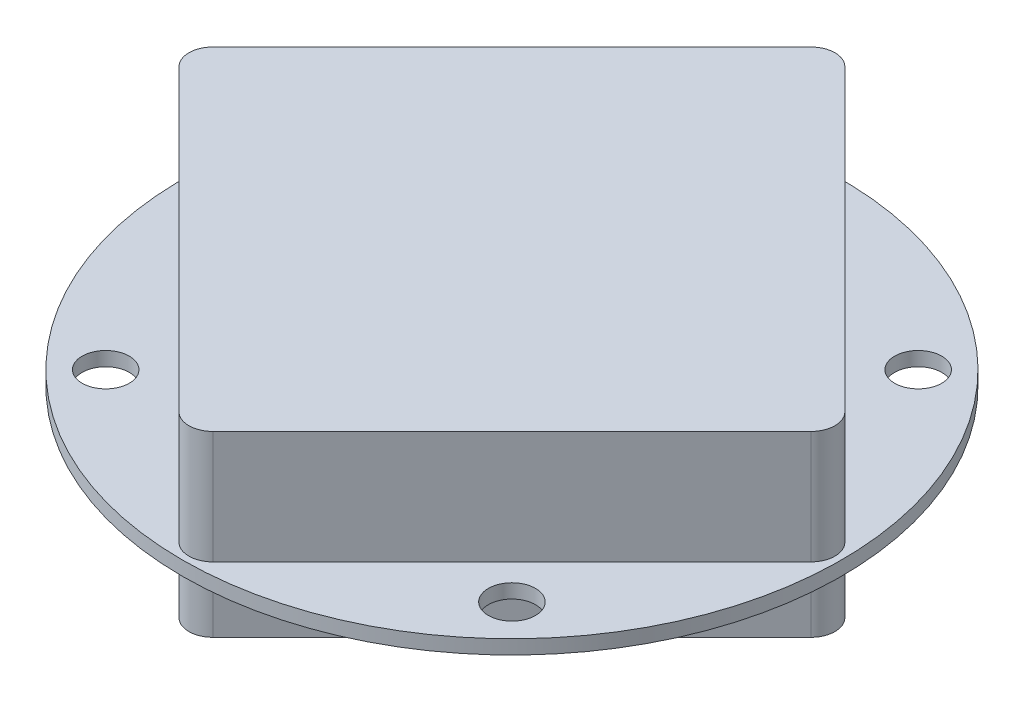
ISO-10303-21;
HEADER;
FILE_DESCRIPTION(('STEP AP214'),'2;1');
FILE_NAME('part.step','',(''),(''),'','','');
FILE_SCHEMA(('AUTOMOTIVE_DESIGN { 1 0 10303 214 1 1 1 1 }'));
ENDSEC;
DATA;
#1=APPLICATION_CONTEXT('core data for automotive mechanical design processes');
#2=APPLICATION_PROTOCOL_DEFINITION('international standard','automotive_design',2000,#1);
#3=PRODUCT_CONTEXT('',#1,'mechanical');
#4=PRODUCT('Part','Part','',(#3));
#5=PRODUCT_RELATED_PRODUCT_CATEGORY('part','',(#4));
#6=PRODUCT_DEFINITION_FORMATION('','',#4);
#7=PRODUCT_DEFINITION_CONTEXT('part definition',#1,'design');
#8=PRODUCT_DEFINITION('design','',#6,#7);
#9=PRODUCT_DEFINITION_SHAPE('','',#8);
#10=(LENGTH_UNIT() NAMED_UNIT(*) SI_UNIT(.MILLI.,.METRE.));
#11=(NAMED_UNIT(*) PLANE_ANGLE_UNIT() SI_UNIT($,.RADIAN.));
#12=(NAMED_UNIT(*) SI_UNIT($,.STERADIAN.) SOLID_ANGLE_UNIT());
#13=UNCERTAINTY_MEASURE_WITH_UNIT(LENGTH_MEASURE(1.E-05),#10,'distance_accuracy_value','');
#14=(GEOMETRIC_REPRESENTATION_CONTEXT(3) GLOBAL_UNCERTAINTY_ASSIGNED_CONTEXT((#13)) GLOBAL_UNIT_ASSIGNED_CONTEXT((#10,
#11,#12)) REPRESENTATION_CONTEXT('',''));
#15=CARTESIAN_POINT('',(0.,0.,0.));
#16=DIRECTION('',(0.,0.,1.));
#17=DIRECTION('',(1.,0.,0.));
#18=AXIS2_PLACEMENT_3D('',#15,#16,#17);
#19=CARTESIAN_POINT('',(0.,0.,0.));
#20=DIRECTION('',(0.,1.,0.));
#21=DIRECTION('',(0.,0.,1.));
#22=AXIS2_PLACEMENT_3D('',#19,#20,#21);
#23=PLANE('',#22);
#24=CARTESIAN_POINT('',(-10.6804635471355,0.,-10.6804635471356));
#25=DIRECTION('',(0.,1.,0.));
#26=DIRECTION('',(0.,0.,1.));
#27=AXIS2_PLACEMENT_3D('',#24,#25,#26);
#28=CIRCLE('',#27,1.24999999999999);
#29=CARTESIAN_POINT('',(-10.6804635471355,0.,-9.43046354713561));
#30=VERTEX_POINT('',#29);
#31=EDGE_CURVE('E319',#30,#30,#28,.T.);
#32=ORIENTED_EDGE('',*,*,#31,.T.);
#33=EDGE_LOOP('',(#32));
#34=FACE_BOUND('',#33,.T.);
#35=CARTESIAN_POINT('',(10.785449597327,0.,-10.7854495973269));
#36=DIRECTION('',(0.,1.,0.));
#37=DIRECTION('',(0.,0.,1.));
#38=AXIS2_PLACEMENT_3D('',#35,#36,#37);
#39=CIRCLE('',#38,1.24999999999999);
#40=CARTESIAN_POINT('',(10.785449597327,0.,-9.53544959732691));
#41=VERTEX_POINT('',#40);
#42=EDGE_CURVE('E313',#41,#41,#39,.T.);
#43=ORIENTED_EDGE('',*,*,#42,.T.);
#44=EDGE_LOOP('',(#43));
#45=FACE_BOUND('',#44,.T.);
#46=CARTESIAN_POINT('',(10.6804635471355,0.,10.6804635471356));
#47=DIRECTION('',(0.,1.,0.));
#48=DIRECTION('',(0.,0.,1.));
#49=AXIS2_PLACEMENT_3D('',#46,#47,#48);
#50=CIRCLE('',#49,1.24999999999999);
#51=CARTESIAN_POINT('',(10.6804635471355,0.,11.9304635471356));
#52=VERTEX_POINT('',#51);
#53=EDGE_CURVE('E307',#52,#52,#50,.T.);
#54=ORIENTED_EDGE('',*,*,#53,.T.);
#55=EDGE_LOOP('',(#54));
#56=FACE_BOUND('',#55,.T.);
#57=CARTESIAN_POINT('',(-10.785449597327,0.,10.7854495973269));
#58=DIRECTION('',(0.,1.,0.));
#59=DIRECTION('',(0.,0.,1.));
#60=AXIS2_PLACEMENT_3D('',#57,#58,#59);
#61=CIRCLE('',#60,1.24999999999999);
#62=CARTESIAN_POINT('',(-10.785449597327,0.,12.0354495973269));
#63=VERTEX_POINT('',#62);
#64=EDGE_CURVE('E239',#63,#63,#61,.T.);
#65=ORIENTED_EDGE('',*,*,#64,.T.);
#66=EDGE_LOOP('',(#65));
#67=FACE_BOUND('',#66,.T.);
#68=CARTESIAN_POINT('',(0.,0.,0.));
#69=DIRECTION('',(0.,1.,0.));
#70=DIRECTION('',(0.,0.,1.));
#71=AXIS2_PLACEMENT_3D('',#68,#69,#70);
#72=CIRCLE('',#71,17.5);
#73=CARTESIAN_POINT('',(0.,0.,17.5));
#74=VERTEX_POINT('',#73);
#75=EDGE_CURVE('E37',#74,#74,#72,.T.);
#76=ORIENTED_EDGE('',*,*,#75,.F.);
#77=EDGE_LOOP('',(#76));
#78=FACE_BOUND('',#77,.T.);
#79=CARTESIAN_POINT('',(0.,0.,-15.8816183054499));
#80=DIRECTION('',(0.,-1.,0.));
#81=DIRECTION('',(0.,0.,-1.));
#82=AXIS2_PLACEMENT_3D('',#79,#80,#81);
#83=CIRCLE('',#82,1.26999999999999);
#84=CARTESIAN_POINT('',(-0.898025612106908,0.,-16.7796439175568));
#85=VERTEX_POINT('',#84);
#86=CARTESIAN_POINT('',(0.898025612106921,0.,-16.7796439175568));
#87=VERTEX_POINT('',#86);
#88=EDGE_CURVE('E166',#85,#87,#83,.T.);
#89=ORIENTED_EDGE('',*,*,#88,.F.);
#90=DIRECTION('',(0.707106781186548,0.,-0.707106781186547));
#91=VECTOR('',#90,1.);
#92=CARTESIAN_POINT('',(-0.898025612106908,0.,-16.7796439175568));
#93=LINE('',#92,#91);
#94=CARTESIAN_POINT('',(-16.7796439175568,0.,-0.898025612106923));
#95=VERTEX_POINT('',#94);
#96=EDGE_CURVE('E163',#95,#85,#93,.T.);
#97=ORIENTED_EDGE('',*,*,#96,.F.);
#98=CARTESIAN_POINT('',(-15.8816183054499,0.,0.));
#99=DIRECTION('',(0.,-1.,0.));
#100=DIRECTION('',(0.,0.,-1.));
#101=AXIS2_PLACEMENT_3D('',#98,#99,#100);
#102=CIRCLE('',#101,1.27);
#103=CARTESIAN_POINT('',(-16.7796439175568,0.,0.898025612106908));
#104=VERTEX_POINT('',#103);
#105=EDGE_CURVE('E247',#104,#95,#102,.T.);
#106=ORIENTED_EDGE('',*,*,#105,.F.);
#107=DIRECTION('',(-0.707106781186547,0.,-0.707106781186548));
#108=VECTOR('',#107,1.);
#109=CARTESIAN_POINT('',(-16.7796439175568,0.,0.89802561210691));
#110=LINE('',#109,#108);
#111=CARTESIAN_POINT('',(-0.898025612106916,0.,16.7796439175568));
#112=VERTEX_POINT('',#111);
#113=EDGE_CURVE('E281',#112,#104,#110,.T.);
#114=ORIENTED_EDGE('',*,*,#113,.F.);
#115=CARTESIAN_POINT('',(0.,0.,15.8816183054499));
#116=DIRECTION('',(0.,-1.,0.));
#117=DIRECTION('',(0.,0.,-1.));
#118=AXIS2_PLACEMENT_3D('',#115,#116,#117);
#119=CIRCLE('',#118,1.27);
#120=CARTESIAN_POINT('',(0.898025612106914,0.,16.7796439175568));
#121=VERTEX_POINT('',#120);
#122=EDGE_CURVE('E275',#121,#112,#119,.T.);
#123=ORIENTED_EDGE('',*,*,#122,.F.);
#124=DIRECTION('',(-0.707106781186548,0.,0.707106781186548));
#125=VECTOR('',#124,1.);
#126=CARTESIAN_POINT('',(16.7796439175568,0.,0.898025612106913));
#127=LINE('',#126,#125);
#128=CARTESIAN_POINT('',(16.7796439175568,0.,0.898025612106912));
#129=VERTEX_POINT('',#128);
#130=EDGE_CURVE('E270',#129,#121,#127,.T.);
#131=ORIENTED_EDGE('',*,*,#130,.F.);
#132=CARTESIAN_POINT('',(15.8816183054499,0.,0.));
#133=DIRECTION('',(0.,-1.,0.));
#134=DIRECTION('',(0.,0.,-1.));
#135=AXIS2_PLACEMENT_3D('',#132,#133,#134);
#136=CIRCLE('',#135,1.27);
#137=CARTESIAN_POINT('',(16.7796439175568,0.,-0.898025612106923));
#138=VERTEX_POINT('',#137);
#139=EDGE_CURVE('E53',#138,#129,#136,.T.);
#140=ORIENTED_EDGE('',*,*,#139,.F.);
#141=DIRECTION('',(0.707106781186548,0.,0.707106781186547));
#142=VECTOR('',#141,1.);
#143=CARTESIAN_POINT('',(16.7796439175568,0.,-0.898025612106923));
#144=LINE('',#143,#142);
#145=EDGE_CURVE('E48',#87,#138,#144,.T.);
#146=ORIENTED_EDGE('',*,*,#145,.F.);
#147=EDGE_LOOP('',(#89,#97,#106,#114,#123,#131,#140,#146));
#148=FACE_BOUND('',#147,.T.);
#149=ADVANCED_FACE('F33',(#34,#45,#56,#67,#78,#148),#23,.F.);
#150=CARTESIAN_POINT('',(0.,0.75,0.));
#151=DIRECTION('',(0.,1.,0.));
#152=DIRECTION('',(0.,0.,1.));
#153=AXIS2_PLACEMENT_3D('',#150,#151,#152);
#154=PLANE('',#153);
#155=CARTESIAN_POINT('',(-10.6804635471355,0.75,-10.6804635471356));
#156=DIRECTION('',(0.,1.,0.));
#157=DIRECTION('',(0.,0.,1.));
#158=AXIS2_PLACEMENT_3D('',#155,#156,#157);
#159=CIRCLE('',#158,1.24999999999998);
#160=CARTESIAN_POINT('',(-10.6804635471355,0.75,-9.43046354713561));
#161=VERTEX_POINT('',#160);
#162=EDGE_CURVE('E322',#161,#161,#159,.T.);
#163=ORIENTED_EDGE('',*,*,#162,.F.);
#164=EDGE_LOOP('',(#163));
#165=FACE_BOUND('',#164,.T.);
#166=CARTESIAN_POINT('',(10.785449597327,0.75,-10.7854495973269));
#167=DIRECTION('',(0.,1.,0.));
#168=DIRECTION('',(0.,0.,1.));
#169=AXIS2_PLACEMENT_3D('',#166,#167,#168);
#170=CIRCLE('',#169,1.24999999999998);
#171=CARTESIAN_POINT('',(10.785449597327,0.75,-9.53544959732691));
#172=VERTEX_POINT('',#171);
#173=EDGE_CURVE('E316',#172,#172,#170,.T.);
#174=ORIENTED_EDGE('',*,*,#173,.F.);
#175=EDGE_LOOP('',(#174));
#176=FACE_BOUND('',#175,.T.);
#177=CARTESIAN_POINT('',(10.6804635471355,0.75,10.6804635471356));
#178=DIRECTION('',(0.,1.,0.));
#179=DIRECTION('',(0.,0.,1.));
#180=AXIS2_PLACEMENT_3D('',#177,#178,#179);
#181=CIRCLE('',#180,1.24999999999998);
#182=CARTESIAN_POINT('',(10.6804635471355,0.75,11.9304635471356));
#183=VERTEX_POINT('',#182);
#184=EDGE_CURVE('E310',#183,#183,#181,.T.);
#185=ORIENTED_EDGE('',*,*,#184,.F.);
#186=EDGE_LOOP('',(#185));
#187=FACE_BOUND('',#186,.T.);
#188=CARTESIAN_POINT('',(-10.785449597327,0.75,10.7854495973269));
#189=DIRECTION('',(0.,1.,0.));
#190=DIRECTION('',(0.,0.,1.));
#191=AXIS2_PLACEMENT_3D('',#188,#189,#190);
#192=CIRCLE('',#191,1.24999999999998);
#193=CARTESIAN_POINT('',(-10.785449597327,0.75,12.0354495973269));
#194=VERTEX_POINT('',#193);
#195=EDGE_CURVE('E304',#194,#194,#192,.T.);
#196=ORIENTED_EDGE('',*,*,#195,.F.);
#197=EDGE_LOOP('',(#196));
#198=FACE_BOUND('',#197,.T.);
#199=CARTESIAN_POINT('',(0.,0.75,0.));
#200=DIRECTION('',(0.,1.,0.));
#201=DIRECTION('',(0.,0.,1.));
#202=AXIS2_PLACEMENT_3D('',#199,#200,#201);
#203=CIRCLE('',#202,17.5);
#204=CARTESIAN_POINT('',(0.,0.75,17.5));
#205=VERTEX_POINT('',#204);
#206=EDGE_CURVE('E11',#205,#205,#203,.T.);
#207=ORIENTED_EDGE('',*,*,#206,.T.);
#208=EDGE_LOOP('',(#207));
#209=FACE_BOUND('',#208,.T.);
#210=DIRECTION('',(0.707106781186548,0.,0.707106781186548));
#211=VECTOR('',#210,1.);
#212=CARTESIAN_POINT('',(-16.7796439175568,0.75,0.898025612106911));
#213=LINE('',#212,#211);
#214=CARTESIAN_POINT('',(-16.7796439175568,0.75,0.898025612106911));
#215=VERTEX_POINT('',#214);
#216=CARTESIAN_POINT('',(-0.898025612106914,0.75,16.7796439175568));
#217=VERTEX_POINT('',#216);
#218=EDGE_CURVE('E170',#215,#217,#213,.T.);
#219=ORIENTED_EDGE('',*,*,#218,.F.);
#220=CARTESIAN_POINT('',(-15.8816183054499,0.75,0.));
#221=DIRECTION('',(0.,1.,0.));
#222=DIRECTION('',(0.,0.,-1.));
#223=AXIS2_PLACEMENT_3D('',#220,#221,#222);
#224=CIRCLE('',#223,1.27);
#225=CARTESIAN_POINT('',(-16.7796439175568,0.75,-0.898025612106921));
#226=VERTEX_POINT('',#225);
#227=EDGE_CURVE('E167',#226,#215,#224,.T.);
#228=ORIENTED_EDGE('',*,*,#227,.F.);
#229=DIRECTION('',(-0.707106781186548,0.,0.707106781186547));
#230=VECTOR('',#229,1.);
#231=CARTESIAN_POINT('',(-16.7796439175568,0.75,-0.898025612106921));
#232=LINE('',#231,#230);
#233=CARTESIAN_POINT('',(-0.898025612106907,0.75,-16.7796439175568));
#234=VERTEX_POINT('',#233);
#235=EDGE_CURVE('E180',#234,#226,#232,.T.);
#236=ORIENTED_EDGE('',*,*,#235,.F.);
#237=CARTESIAN_POINT('',(0.,0.75,-15.8816183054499));
#238=DIRECTION('',(0.,1.,0.));
#239=DIRECTION('',(0.,0.,-1.));
#240=AXIS2_PLACEMENT_3D('',#237,#238,#239);
#241=CIRCLE('',#240,1.27);
#242=CARTESIAN_POINT('',(0.898025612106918,0.75,-16.7796439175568));
#243=VERTEX_POINT('',#242);
#244=EDGE_CURVE('E204',#243,#234,#241,.T.);
#245=ORIENTED_EDGE('',*,*,#244,.F.);
#246=DIRECTION('',(-0.707106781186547,0.,-0.707106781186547));
#247=VECTOR('',#246,1.);
#248=CARTESIAN_POINT('',(0.898025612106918,0.75,-16.7796439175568));
#249=LINE('',#248,#247);
#250=CARTESIAN_POINT('',(16.7796439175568,0.75,-0.898025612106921));
#251=VERTEX_POINT('',#250);
#252=EDGE_CURVE('E202',#251,#243,#249,.T.);
#253=ORIENTED_EDGE('',*,*,#252,.F.);
#254=CARTESIAN_POINT('',(15.8816183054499,0.75,0.));
#255=DIRECTION('',(0.,1.,0.));
#256=DIRECTION('',(0.,0.,-1.));
#257=AXIS2_PLACEMENT_3D('',#254,#255,#256);
#258=CIRCLE('',#257,1.27);
#259=CARTESIAN_POINT('',(16.7796439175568,0.75,0.898025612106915));
#260=VERTEX_POINT('',#259);
#261=EDGE_CURVE('E200',#260,#251,#258,.T.);
#262=ORIENTED_EDGE('',*,*,#261,.F.);
#263=DIRECTION('',(0.707106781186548,0.,-0.707106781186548));
#264=VECTOR('',#263,1.);
#265=CARTESIAN_POINT('',(0.898025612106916,0.75,16.7796439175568));
#266=LINE('',#265,#264);
#267=CARTESIAN_POINT('',(0.898025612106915,0.75,16.7796439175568));
#268=VERTEX_POINT('',#267);
#269=EDGE_CURVE('E198',#268,#260,#266,.T.);
#270=ORIENTED_EDGE('',*,*,#269,.F.);
#271=CARTESIAN_POINT('',(0.,0.75,15.8816183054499));
#272=DIRECTION('',(0.,1.,0.));
#273=DIRECTION('',(0.,0.,1.));
#274=AXIS2_PLACEMENT_3D('',#271,#272,#273);
#275=CIRCLE('',#274,1.27);
#276=EDGE_CURVE('E196',#217,#268,#275,.T.);
#277=ORIENTED_EDGE('',*,*,#276,.F.);
#278=EDGE_LOOP('',(#219,#228,#236,#245,#253,#262,#270,#277));
#279=FACE_BOUND('',#278,.T.);
#280=ADVANCED_FACE('F235',(#165,#176,#187,#198,#209,#279),#154,.T.);
#281=CARTESIAN_POINT('',(0.,0.75,0.));
#282=DIRECTION('',(0.,-1.,0.));
#283=DIRECTION('',(0.,0.,-1.));
#284=AXIS2_PLACEMENT_3D('',#281,#282,#283);
#285=CYLINDRICAL_SURFACE('',#284,17.5);
#286=ORIENTED_EDGE('',*,*,#206,.F.);
#287=EDGE_LOOP('',(#286));
#288=FACE_BOUND('',#287,.T.);
#289=ORIENTED_EDGE('',*,*,#75,.T.);
#290=EDGE_LOOP('',(#289));
#291=FACE_BOUND('',#290,.T.);
#292=ADVANCED_FACE('F35',(#288,#291),#285,.T.);
#293=CARTESIAN_POINT('',(-15.8816183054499,6.75,0.));
#294=DIRECTION('',(0.,-1.,0.));
#295=DIRECTION('',(0.,0.,-1.));
#296=AXIS2_PLACEMENT_3D('',#293,#294,#295);
#297=CYLINDRICAL_SURFACE('',#296,1.27);
#298=ORIENTED_EDGE('',*,*,#227,.T.);
#299=DIRECTION('',(0.,-1.,0.));
#300=VECTOR('',#299,1.);
#301=CARTESIAN_POINT('',(-16.7796439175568,6.75,0.898025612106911));
#302=LINE('',#301,#300);
#303=CARTESIAN_POINT('',(-16.7796439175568,6.75,0.898025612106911));
#304=VERTEX_POINT('',#303);
#305=EDGE_CURVE('E227',#304,#215,#302,.T.);
#306=ORIENTED_EDGE('',*,*,#305,.F.);
#307=CARTESIAN_POINT('',(-15.8816183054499,6.75,0.));
#308=DIRECTION('',(0.,1.,0.));
#309=DIRECTION('',(0.,0.,-1.));
#310=AXIS2_PLACEMENT_3D('',#307,#308,#309);
#311=CIRCLE('',#310,1.27);
#312=CARTESIAN_POINT('',(-16.7796439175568,6.75,-0.898025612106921));
#313=VERTEX_POINT('',#312);
#314=EDGE_CURVE('E176',#313,#304,#311,.T.);
#315=ORIENTED_EDGE('',*,*,#314,.F.);
#316=DIRECTION('',(0.,-1.,0.));
#317=VECTOR('',#316,1.);
#318=CARTESIAN_POINT('',(-16.7796439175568,6.75,-0.898025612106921));
#319=LINE('',#318,#317);
#320=EDGE_CURVE('E193',#313,#226,#319,.T.);
#321=ORIENTED_EDGE('',*,*,#320,.T.);
#322=EDGE_LOOP('',(#298,#306,#315,#321));
#323=FACE_BOUND('',#322,.T.);
#324=ADVANCED_FACE('F359',(#323),#297,.T.);
#325=CARTESIAN_POINT('',(-16.7796439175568,6.75,0.898025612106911));
#326=DIRECTION('',(0.707106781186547,0.,-0.707106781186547));
#327=DIRECTION('',(-0.707106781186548,0.,-0.707106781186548));
#328=AXIS2_PLACEMENT_3D('',#325,#326,#327);
#329=PLANE('',#328);
#330=ORIENTED_EDGE('',*,*,#218,.T.);
#331=DIRECTION('',(0.,-1.,0.));
#332=VECTOR('',#331,1.);
#333=CARTESIAN_POINT('',(-0.898025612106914,6.75,16.7796439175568));
#334=LINE('',#333,#332);
#335=CARTESIAN_POINT('',(-0.898025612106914,6.75,16.7796439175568));
#336=VERTEX_POINT('',#335);
#337=EDGE_CURVE('E224',#336,#217,#334,.T.);
#338=ORIENTED_EDGE('',*,*,#337,.F.);
#339=DIRECTION('',(0.707106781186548,0.,0.707106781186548));
#340=VECTOR('',#339,1.);
#341=CARTESIAN_POINT('',(-16.7796439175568,6.75,0.898025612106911));
#342=LINE('',#341,#340);
#343=EDGE_CURVE('E179',#304,#336,#342,.T.);
#344=ORIENTED_EDGE('',*,*,#343,.F.);
#345=ORIENTED_EDGE('',*,*,#305,.T.);
#346=EDGE_LOOP('',(#330,#338,#344,#345));
#347=FACE_BOUND('',#346,.T.);
#348=ADVANCED_FACE('F346',(#347),#329,.F.);
#349=CARTESIAN_POINT('',(0.,6.75,15.8816183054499));
#350=DIRECTION('',(0.,-1.,0.));
#351=DIRECTION('',(0.,0.,-1.));
#352=AXIS2_PLACEMENT_3D('',#349,#350,#351);
#353=CYLINDRICAL_SURFACE('',#352,1.27);
#354=ORIENTED_EDGE('',*,*,#276,.T.);
#355=DIRECTION('',(0.,-1.,0.));
#356=VECTOR('',#355,1.);
#357=CARTESIAN_POINT('',(0.898025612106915,6.75,16.7796439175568));
#358=LINE('',#357,#356);
#359=CARTESIAN_POINT('',(0.898025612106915,6.75,16.7796439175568));
#360=VERTEX_POINT('',#359);
#361=EDGE_CURVE('E221',#360,#268,#358,.T.);
#362=ORIENTED_EDGE('',*,*,#361,.F.);
#363=CARTESIAN_POINT('',(0.,6.75,15.8816183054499));
#364=DIRECTION('',(0.,1.,0.));
#365=DIRECTION('',(0.,0.,1.));
#366=AXIS2_PLACEMENT_3D('',#363,#364,#365);
#367=CIRCLE('',#366,1.27);
#368=EDGE_CURVE('E182',#336,#360,#367,.T.);
#369=ORIENTED_EDGE('',*,*,#368,.F.);
#370=ORIENTED_EDGE('',*,*,#337,.T.);
#371=EDGE_LOOP('',(#354,#362,#369,#370));
#372=FACE_BOUND('',#371,.T.);
#373=ADVANCED_FACE('F349',(#372),#353,.T.);
#374=CARTESIAN_POINT('',(0.898025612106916,6.75,16.7796439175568));
#375=DIRECTION('',(-0.707106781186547,0.,-0.707106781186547));
#376=DIRECTION('',(-0.707106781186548,0.,0.707106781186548));
#377=AXIS2_PLACEMENT_3D('',#374,#375,#376);
#378=PLANE('',#377);
#379=ORIENTED_EDGE('',*,*,#269,.T.);
#380=DIRECTION('',(0.,-1.,0.));
#381=VECTOR('',#380,1.);
#382=CARTESIAN_POINT('',(16.7796439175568,6.75,0.898025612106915));
#383=LINE('',#382,#381);
#384=CARTESIAN_POINT('',(16.7796439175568,6.75,0.898025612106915));
#385=VERTEX_POINT('',#384);
#386=EDGE_CURVE('E218',#385,#260,#383,.T.);
#387=ORIENTED_EDGE('',*,*,#386,.F.);
#388=DIRECTION('',(0.707106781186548,0.,-0.707106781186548));
#389=VECTOR('',#388,1.);
#390=CARTESIAN_POINT('',(0.898025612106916,6.75,16.7796439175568));
#391=LINE('',#390,#389);
#392=EDGE_CURVE('E184',#360,#385,#391,.T.);
#393=ORIENTED_EDGE('',*,*,#392,.F.);
#394=ORIENTED_EDGE('',*,*,#361,.T.);
#395=EDGE_LOOP('',(#379,#387,#393,#394));
#396=FACE_BOUND('',#395,.T.);
#397=ADVANCED_FACE('F378',(#396),#378,.F.);
#398=CARTESIAN_POINT('',(15.8816183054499,6.75,0.));
#399=DIRECTION('',(0.,-1.,0.));
#400=DIRECTION('',(0.,0.,-1.));
#401=AXIS2_PLACEMENT_3D('',#398,#399,#400);
#402=CYLINDRICAL_SURFACE('',#401,1.27);
#403=ORIENTED_EDGE('',*,*,#261,.T.);
#404=DIRECTION('',(0.,-1.,0.));
#405=VECTOR('',#404,1.);
#406=CARTESIAN_POINT('',(16.7796439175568,6.75,-0.898025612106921));
#407=LINE('',#406,#405);
#408=CARTESIAN_POINT('',(16.7796439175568,6.75,-0.898025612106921));
#409=VERTEX_POINT('',#408);
#410=EDGE_CURVE('E215',#409,#251,#407,.T.);
#411=ORIENTED_EDGE('',*,*,#410,.F.);
#412=CARTESIAN_POINT('',(15.8816183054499,6.75,0.));
#413=DIRECTION('',(0.,1.,0.));
#414=DIRECTION('',(0.,0.,-1.));
#415=AXIS2_PLACEMENT_3D('',#412,#413,#414);
#416=CIRCLE('',#415,1.27);
#417=EDGE_CURVE('E186',#385,#409,#416,.T.);
#418=ORIENTED_EDGE('',*,*,#417,.F.);
#419=ORIENTED_EDGE('',*,*,#386,.T.);
#420=EDGE_LOOP('',(#403,#411,#418,#419));
#421=FACE_BOUND('',#420,.T.);
#422=ADVANCED_FACE('F376',(#421),#402,.T.);
#423=CARTESIAN_POINT('',(0.898025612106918,6.75,-16.7796439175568));
#424=DIRECTION('',(-0.707106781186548,0.,0.707106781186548));
#425=DIRECTION('',(0.707106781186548,0.,0.707106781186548));
#426=AXIS2_PLACEMENT_3D('',#423,#424,#425);
#427=PLANE('',#426);
#428=ORIENTED_EDGE('',*,*,#252,.T.);
#429=DIRECTION('',(0.,-1.,0.));
#430=VECTOR('',#429,1.);
#431=CARTESIAN_POINT('',(0.898025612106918,6.75,-16.7796439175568));
#432=LINE('',#431,#430);
#433=CARTESIAN_POINT('',(0.898025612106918,6.75,-16.7796439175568));
#434=VERTEX_POINT('',#433);
#435=EDGE_CURVE('E212',#434,#243,#432,.T.);
#436=ORIENTED_EDGE('',*,*,#435,.F.);
#437=DIRECTION('',(-0.707106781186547,0.,-0.707106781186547));
#438=VECTOR('',#437,1.);
#439=CARTESIAN_POINT('',(0.898025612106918,6.75,-16.7796439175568));
#440=LINE('',#439,#438);
#441=EDGE_CURVE('E188',#409,#434,#440,.T.);
#442=ORIENTED_EDGE('',*,*,#441,.F.);
#443=ORIENTED_EDGE('',*,*,#410,.T.);
#444=EDGE_LOOP('',(#428,#436,#442,#443));
#445=FACE_BOUND('',#444,.T.);
#446=ADVANCED_FACE('F372',(#445),#427,.F.);
#447=CARTESIAN_POINT('',(0.,6.75,-15.8816183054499));
#448=DIRECTION('',(0.,-1.,0.));
#449=DIRECTION('',(0.,0.,-1.));
#450=AXIS2_PLACEMENT_3D('',#447,#448,#449);
#451=CYLINDRICAL_SURFACE('',#450,1.27);
#452=ORIENTED_EDGE('',*,*,#244,.T.);
#453=DIRECTION('',(0.,-1.,0.));
#454=VECTOR('',#453,1.);
#455=CARTESIAN_POINT('',(-0.898025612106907,6.75,-16.7796439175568));
#456=LINE('',#455,#454);
#457=CARTESIAN_POINT('',(-0.898025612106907,6.75,-16.7796439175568));
#458=VERTEX_POINT('',#457);
#459=EDGE_CURVE('E210',#458,#234,#456,.T.);
#460=ORIENTED_EDGE('',*,*,#459,.F.);
#461=CARTESIAN_POINT('',(0.,6.75,-15.8816183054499));
#462=DIRECTION('',(0.,1.,0.));
#463=DIRECTION('',(0.,0.,-1.));
#464=AXIS2_PLACEMENT_3D('',#461,#462,#463);
#465=CIRCLE('',#464,1.27);
#466=EDGE_CURVE('E190',#434,#458,#465,.T.);
#467=ORIENTED_EDGE('',*,*,#466,.F.);
#468=ORIENTED_EDGE('',*,*,#435,.T.);
#469=EDGE_LOOP('',(#452,#460,#467,#468));
#470=FACE_BOUND('',#469,.T.);
#471=ADVANCED_FACE('F367',(#470),#451,.T.);
#472=CARTESIAN_POINT('',(-16.7796439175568,6.75,-0.898025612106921));
#473=DIRECTION('',(0.707106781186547,0.,0.707106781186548));
#474=DIRECTION('',(0.707106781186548,0.,-0.707106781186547));
#475=AXIS2_PLACEMENT_3D('',#472,#473,#474);
#476=PLANE('',#475);
#477=ORIENTED_EDGE('',*,*,#235,.T.);
#478=ORIENTED_EDGE('',*,*,#320,.F.);
#479=DIRECTION('',(-0.707106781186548,0.,0.707106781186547));
#480=VECTOR('',#479,1.);
#481=CARTESIAN_POINT('',(-16.7796439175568,6.75,-0.898025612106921));
#482=LINE('',#481,#480);
#483=EDGE_CURVE('E192',#458,#313,#482,.T.);
#484=ORIENTED_EDGE('',*,*,#483,.F.);
#485=ORIENTED_EDGE('',*,*,#459,.T.);
#486=EDGE_LOOP('',(#477,#478,#484,#485));
#487=FACE_BOUND('',#486,.T.);
#488=ADVANCED_FACE('F361',(#487),#476,.F.);
#489=CARTESIAN_POINT('',(-15.8816183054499,6.75,0.));
#490=DIRECTION('',(0.,-1.,0.));
#491=DIRECTION('',(0.,0.,-1.));
#492=AXIS2_PLACEMENT_3D('',#489,#490,#491);
#493=PLANE('',#492);
#494=ORIENTED_EDGE('',*,*,#314,.T.);
#495=ORIENTED_EDGE('',*,*,#343,.T.);
#496=ORIENTED_EDGE('',*,*,#368,.T.);
#497=ORIENTED_EDGE('',*,*,#392,.T.);
#498=ORIENTED_EDGE('',*,*,#417,.T.);
#499=ORIENTED_EDGE('',*,*,#441,.T.);
#500=ORIENTED_EDGE('',*,*,#466,.T.);
#501=ORIENTED_EDGE('',*,*,#483,.T.);
#502=EDGE_LOOP('',(#494,#495,#496,#497,#498,#499,#500,#501));
#503=FACE_BOUND('',#502,.T.);
#504=ADVANCED_FACE('F353',(#503),#493,.F.);
#505=CARTESIAN_POINT('',(0.,-2.72,-15.8816183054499));
#506=DIRECTION('',(0.,1.,0.));
#507=DIRECTION('',(0.,0.,1.));
#508=AXIS2_PLACEMENT_3D('',#505,#506,#507);
#509=CYLINDRICAL_SURFACE('',#508,1.26999999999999);
#510=ORIENTED_EDGE('',*,*,#88,.T.);
#511=DIRECTION('',(0.,1.,0.));
#512=VECTOR('',#511,1.);
#513=CARTESIAN_POINT('',(0.898025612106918,-2.72,-16.7796439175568));
#514=LINE('',#513,#512);
#515=CARTESIAN_POINT('',(0.898025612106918,-2.72,-16.7796439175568));
#516=VERTEX_POINT('',#515);
#517=EDGE_CURVE('E147',#516,#87,#514,.T.);
#518=ORIENTED_EDGE('',*,*,#517,.F.);
#519=CARTESIAN_POINT('',(0.,-2.72,-15.8816183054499));
#520=DIRECTION('',(0.,-1.,0.));
#521=DIRECTION('',(0.,0.,-1.));
#522=AXIS2_PLACEMENT_3D('',#519,#520,#521);
#523=CIRCLE('',#522,1.26999999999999);
#524=CARTESIAN_POINT('',(-0.898025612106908,-2.72,-16.7796439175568));
#525=VERTEX_POINT('',#524);
#526=EDGE_CURVE('E154',#525,#516,#523,.T.);
#527=ORIENTED_EDGE('',*,*,#526,.F.);
#528=DIRECTION('',(0.,1.,0.));
#529=VECTOR('',#528,1.);
#530=CARTESIAN_POINT('',(-0.898025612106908,-2.72,-16.7796439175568));
#531=LINE('',#530,#529);
#532=EDGE_CURVE('E244',#525,#85,#531,.T.);
#533=ORIENTED_EDGE('',*,*,#532,.T.);
#534=EDGE_LOOP('',(#510,#518,#527,#533));
#535=FACE_BOUND('',#534,.T.);
#536=ADVANCED_FACE('F165',(#535),#509,.T.);
#537=CARTESIAN_POINT('',(16.7796439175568,-2.72,-0.898025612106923));
#538=DIRECTION('',(-0.707106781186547,0.,0.707106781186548));
#539=DIRECTION('',(0.707106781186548,0.,0.707106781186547));
#540=AXIS2_PLACEMENT_3D('',#537,#538,#539);
#541=PLANE('',#540);
#542=ORIENTED_EDGE('',*,*,#145,.T.);
#543=DIRECTION('',(0.,1.,0.));
#544=VECTOR('',#543,1.);
#545=CARTESIAN_POINT('',(16.7796439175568,-2.72,-0.898025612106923));
#546=LINE('',#545,#544);
#547=CARTESIAN_POINT('',(16.7796439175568,-2.72,-0.898025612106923));
#548=VERTEX_POINT('',#547);
#549=EDGE_CURVE('E150',#548,#138,#546,.T.);
#550=ORIENTED_EDGE('',*,*,#549,.F.);
#551=DIRECTION('',(0.707106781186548,0.,0.707106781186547));
#552=VECTOR('',#551,1.);
#553=CARTESIAN_POINT('',(16.7796439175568,-2.72,-0.898025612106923));
#554=LINE('',#553,#552);
#555=EDGE_CURVE('E143',#516,#548,#554,.T.);
#556=ORIENTED_EDGE('',*,*,#555,.F.);
#557=ORIENTED_EDGE('',*,*,#517,.T.);
#558=EDGE_LOOP('',(#542,#550,#556,#557));
#559=FACE_BOUND('',#558,.T.);
#560=ADVANCED_FACE('F145',(#559),#541,.F.);
#561=CARTESIAN_POINT('',(15.8816183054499,-2.72,0.));
#562=DIRECTION('',(0.,1.,0.));
#563=DIRECTION('',(0.,0.,1.));
#564=AXIS2_PLACEMENT_3D('',#561,#562,#563);
#565=CYLINDRICAL_SURFACE('',#564,1.27);
#566=ORIENTED_EDGE('',*,*,#139,.T.);
#567=DIRECTION('',(0.,1.,0.));
#568=VECTOR('',#567,1.);
#569=CARTESIAN_POINT('',(16.7796439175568,-2.72,0.898025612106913));
#570=LINE('',#569,#568);
#571=CARTESIAN_POINT('',(16.7796439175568,-2.72,0.898025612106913));
#572=VERTEX_POINT('',#571);
#573=EDGE_CURVE('E172',#572,#129,#570,.T.);
#574=ORIENTED_EDGE('',*,*,#573,.F.);
#575=CARTESIAN_POINT('',(15.8816183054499,-2.72,0.));
#576=DIRECTION('',(0.,-1.,0.));
#577=DIRECTION('',(0.,0.,-1.));
#578=AXIS2_PLACEMENT_3D('',#575,#576,#577);
#579=CIRCLE('',#578,1.27);
#580=EDGE_CURVE('E153',#548,#572,#579,.T.);
#581=ORIENTED_EDGE('',*,*,#580,.F.);
#582=ORIENTED_EDGE('',*,*,#549,.T.);
#583=EDGE_LOOP('',(#566,#574,#581,#582));
#584=FACE_BOUND('',#583,.T.);
#585=ADVANCED_FACE('F273',(#584),#565,.T.);
#586=CARTESIAN_POINT('',(16.7796439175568,-2.72,0.898025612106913));
#587=DIRECTION('',(-0.707106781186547,0.,-0.707106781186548));
#588=DIRECTION('',(-0.707106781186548,0.,0.707106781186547));
#589=AXIS2_PLACEMENT_3D('',#586,#587,#588);
#590=PLANE('',#589);
#591=ORIENTED_EDGE('',*,*,#130,.T.);
#592=DIRECTION('',(0.,1.,0.));
#593=VECTOR('',#592,1.);
#594=CARTESIAN_POINT('',(0.898025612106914,-2.72,16.7796439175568));
#595=LINE('',#594,#593);
#596=CARTESIAN_POINT('',(0.898025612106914,-2.72,16.7796439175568));
#597=VERTEX_POINT('',#596);
#598=EDGE_CURVE('E261',#597,#121,#595,.T.);
#599=ORIENTED_EDGE('',*,*,#598,.F.);
#600=DIRECTION('',(-0.707106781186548,0.,0.707106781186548));
#601=VECTOR('',#600,1.);
#602=CARTESIAN_POINT('',(16.7796439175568,-2.72,0.898025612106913));
#603=LINE('',#602,#601);
#604=EDGE_CURVE('E271',#572,#597,#603,.T.);
#605=ORIENTED_EDGE('',*,*,#604,.F.);
#606=ORIENTED_EDGE('',*,*,#573,.T.);
#607=EDGE_LOOP('',(#591,#599,#605,#606));
#608=FACE_BOUND('',#607,.T.);
#609=ADVANCED_FACE('F268',(#608),#590,.F.);
#610=CARTESIAN_POINT('',(0.,-2.72,15.8816183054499));
#611=DIRECTION('',(0.,1.,0.));
#612=DIRECTION('',(0.,0.,1.));
#613=AXIS2_PLACEMENT_3D('',#610,#611,#612);
#614=CYLINDRICAL_SURFACE('',#613,1.27);
#615=ORIENTED_EDGE('',*,*,#122,.T.);
#616=DIRECTION('',(0.,1.,0.));
#617=VECTOR('',#616,1.);
#618=CARTESIAN_POINT('',(-0.898025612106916,-2.72,16.7796439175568));
#619=LINE('',#618,#617);
#620=CARTESIAN_POINT('',(-0.898025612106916,-2.72,16.7796439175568));
#621=VERTEX_POINT('',#620);
#622=EDGE_CURVE('E258',#621,#112,#619,.T.);
#623=ORIENTED_EDGE('',*,*,#622,.F.);
#624=CARTESIAN_POINT('',(0.,-2.72,15.8816183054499));
#625=DIRECTION('',(0.,-1.,0.));
#626=DIRECTION('',(0.,0.,-1.));
#627=AXIS2_PLACEMENT_3D('',#624,#625,#626);
#628=CIRCLE('',#627,1.27);
#629=EDGE_CURVE('E295',#597,#621,#628,.T.);
#630=ORIENTED_EDGE('',*,*,#629,.F.);
#631=ORIENTED_EDGE('',*,*,#598,.T.);
#632=EDGE_LOOP('',(#615,#623,#630,#631));
#633=FACE_BOUND('',#632,.T.);
#634=ADVANCED_FACE('F294',(#633),#614,.T.);
#635=CARTESIAN_POINT('',(-16.7796439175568,-2.72,0.89802561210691));
#636=DIRECTION('',(0.707106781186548,0.,-0.707106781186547));
#637=DIRECTION('',(-0.707106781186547,0.,-0.707106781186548));
#638=AXIS2_PLACEMENT_3D('',#635,#636,#637);
#639=PLANE('',#638);
#640=ORIENTED_EDGE('',*,*,#113,.T.);
#641=DIRECTION('',(0.,1.,0.));
#642=VECTOR('',#641,1.);
#643=CARTESIAN_POINT('',(-16.7796439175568,-2.72,0.898025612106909));
#644=LINE('',#643,#642);
#645=CARTESIAN_POINT('',(-16.7796439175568,-2.72,0.898025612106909));
#646=VERTEX_POINT('',#645);
#647=EDGE_CURVE('E250',#646,#104,#644,.T.);
#648=ORIENTED_EDGE('',*,*,#647,.F.);
#649=DIRECTION('',(-0.707106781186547,0.,-0.707106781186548));
#650=VECTOR('',#649,1.);
#651=CARTESIAN_POINT('',(-16.7796439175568,-2.72,0.89802561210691));
#652=LINE('',#651,#650);
#653=EDGE_CURVE('E291',#621,#646,#652,.T.);
#654=ORIENTED_EDGE('',*,*,#653,.F.);
#655=ORIENTED_EDGE('',*,*,#622,.T.);
#656=EDGE_LOOP('',(#640,#648,#654,#655));
#657=FACE_BOUND('',#656,.T.);
#658=ADVANCED_FACE('F288',(#657),#639,.F.);
#659=CARTESIAN_POINT('',(-15.8816183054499,-2.72,0.));
#660=DIRECTION('',(0.,1.,0.));
#661=DIRECTION('',(0.,0.,1.));
#662=AXIS2_PLACEMENT_3D('',#659,#660,#661);
#663=CYLINDRICAL_SURFACE('',#662,1.27);
#664=ORIENTED_EDGE('',*,*,#105,.T.);
#665=DIRECTION('',(0.,1.,0.));
#666=VECTOR('',#665,1.);
#667=CARTESIAN_POINT('',(-16.7796439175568,-2.72,-0.898025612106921));
#668=LINE('',#667,#666);
#669=CARTESIAN_POINT('',(-16.7796439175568,-2.72,-0.898025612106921));
#670=VERTEX_POINT('',#669);
#671=EDGE_CURVE('E246',#670,#95,#668,.T.);
#672=ORIENTED_EDGE('',*,*,#671,.F.);
#673=CARTESIAN_POINT('',(-15.8816183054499,-2.72,0.));
#674=DIRECTION('',(0.,-1.,0.));
#675=DIRECTION('',(0.,0.,-1.));
#676=AXIS2_PLACEMENT_3D('',#673,#674,#675);
#677=CIRCLE('',#676,1.27);
#678=EDGE_CURVE('E252',#646,#670,#677,.T.);
#679=ORIENTED_EDGE('',*,*,#678,.F.);
#680=ORIENTED_EDGE('',*,*,#647,.T.);
#681=EDGE_LOOP('',(#664,#672,#679,#680));
#682=FACE_BOUND('',#681,.T.);
#683=ADVANCED_FACE('F284',(#682),#663,.T.);
#684=CARTESIAN_POINT('',(-0.898025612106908,-2.72,-16.7796439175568));
#685=DIRECTION('',(0.707106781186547,0.,0.707106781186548));
#686=DIRECTION('',(0.707106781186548,0.,-0.707106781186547));
#687=AXIS2_PLACEMENT_3D('',#684,#685,#686);
#688=PLANE('',#687);
#689=ORIENTED_EDGE('',*,*,#96,.T.);
#690=ORIENTED_EDGE('',*,*,#532,.F.);
#691=DIRECTION('',(0.707106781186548,0.,-0.707106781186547));
#692=VECTOR('',#691,1.);
#693=CARTESIAN_POINT('',(-0.898025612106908,-2.72,-16.7796439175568));
#694=LINE('',#693,#692);
#695=EDGE_CURVE('E159',#670,#525,#694,.T.);
#696=ORIENTED_EDGE('',*,*,#695,.F.);
#697=ORIENTED_EDGE('',*,*,#671,.T.);
#698=EDGE_LOOP('',(#689,#690,#696,#697));
#699=FACE_BOUND('',#698,.T.);
#700=ADVANCED_FACE('F243',(#699),#688,.F.);
#701=CARTESIAN_POINT('',(0.,-2.72,-15.8816183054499));
#702=DIRECTION('',(0.,-1.,0.));
#703=DIRECTION('',(0.,0.,-1.));
#704=AXIS2_PLACEMENT_3D('',#701,#702,#703);
#705=PLANE('',#704);
#706=ORIENTED_EDGE('',*,*,#526,.T.);
#707=ORIENTED_EDGE('',*,*,#555,.T.);
#708=ORIENTED_EDGE('',*,*,#580,.T.);
#709=ORIENTED_EDGE('',*,*,#604,.T.);
#710=ORIENTED_EDGE('',*,*,#629,.T.);
#711=ORIENTED_EDGE('',*,*,#653,.T.);
#712=ORIENTED_EDGE('',*,*,#678,.T.);
#713=ORIENTED_EDGE('',*,*,#695,.T.);
#714=EDGE_LOOP('',(#706,#707,#708,#709,#710,#711,#712,#713));
#715=FACE_BOUND('',#714,.T.);
#716=ADVANCED_FACE('F157',(#715),#705,.T.);
#717=CARTESIAN_POINT('',(-10.785449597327,0.75,10.7854495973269));
#718=DIRECTION('',(0.,1.,0.));
#719=DIRECTION('',(0.,0.,1.));
#720=AXIS2_PLACEMENT_3D('',#717,#718,#719);
#721=CYLINDRICAL_SURFACE('',#720,1.24999999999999);
#722=ORIENTED_EDGE('',*,*,#195,.T.);
#723=EDGE_LOOP('',(#722));
#724=FACE_BOUND('',#723,.T.);
#725=ORIENTED_EDGE('',*,*,#64,.F.);
#726=EDGE_LOOP('',(#725));
#727=FACE_BOUND('',#726,.T.);
#728=ADVANCED_FACE('F418',(#724,#727),#721,.F.);
#729=CARTESIAN_POINT('',(10.6804635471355,0.75,10.6804635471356));
#730=DIRECTION('',(0.,1.,0.));
#731=DIRECTION('',(0.,0.,1.));
#732=AXIS2_PLACEMENT_3D('',#729,#730,#731);
#733=CYLINDRICAL_SURFACE('',#732,1.24999999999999);
#734=ORIENTED_EDGE('',*,*,#184,.T.);
#735=EDGE_LOOP('',(#734));
#736=FACE_BOUND('',#735,.T.);
#737=ORIENTED_EDGE('',*,*,#53,.F.);
#738=EDGE_LOOP('',(#737));
#739=FACE_BOUND('',#738,.T.);
#740=ADVANCED_FACE('F549',(#736,#739),#733,.F.);
#741=CARTESIAN_POINT('',(10.785449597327,0.75,-10.7854495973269));
#742=DIRECTION('',(0.,1.,0.));
#743=DIRECTION('',(0.,0.,1.));
#744=AXIS2_PLACEMENT_3D('',#741,#742,#743);
#745=CYLINDRICAL_SURFACE('',#744,1.24999999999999);
#746=ORIENTED_EDGE('',*,*,#173,.T.);
#747=EDGE_LOOP('',(#746));
#748=FACE_BOUND('',#747,.T.);
#749=ORIENTED_EDGE('',*,*,#42,.F.);
#750=EDGE_LOOP('',(#749));
#751=FACE_BOUND('',#750,.T.);
#752=ADVANCED_FACE('F553',(#748,#751),#745,.F.);
#753=CARTESIAN_POINT('',(-10.6804635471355,0.75,-10.6804635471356));
#754=DIRECTION('',(0.,1.,0.));
#755=DIRECTION('',(0.,0.,1.));
#756=AXIS2_PLACEMENT_3D('',#753,#754,#755);
#757=CYLINDRICAL_SURFACE('',#756,1.24999999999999);
#758=ORIENTED_EDGE('',*,*,#162,.T.);
#759=EDGE_LOOP('',(#758));
#760=FACE_BOUND('',#759,.T.);
#761=ORIENTED_EDGE('',*,*,#31,.F.);
#762=EDGE_LOOP('',(#761));
#763=FACE_BOUND('',#762,.T.);
#764=ADVANCED_FACE('F326',(#760,#763),#757,.F.);
#765=CLOSED_SHELL('',(#149,#280,#292,#324,#348,#373,#397,#422,#446,#471,#488,#504,#536,#560,
#585,#609,#634,#658,#683,#700,#716,#728,#740,#752,#764));
#766=MANIFOLD_SOLID_BREP('B2',#765);
#767=ADVANCED_BREP_SHAPE_REPRESENTATION('',(#18,#766),#14);
#768=SHAPE_DEFINITION_REPRESENTATION(#9,#767);
ENDSEC;
END-ISO-10303-21;
